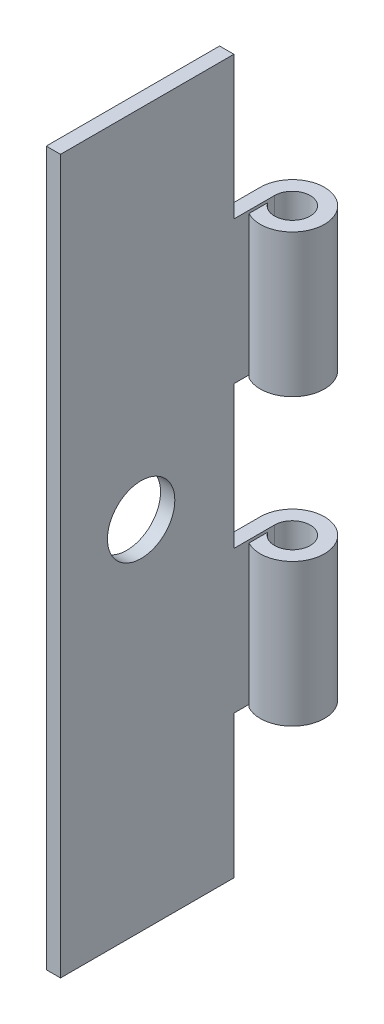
from build123d import *

# Parameters (mm, degrees)
BOSS_EXTRUDE1_DEPTH = 31.75
BOSS_EXTRUDE2_DEPTH = 31.75
SKETCH7_W           = 3.6195
SKETCH7_H           = 6.35
CUT_EXTRUDE2_DEPTH  = 34.270909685
SKETCH8_W           = 3.6195
SKETCH8_H           = 6.35
CUT_EXTRUDE3_DEPTH  = 34.270909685
SKETCH10_W          = 3.6195
SKETCH10_H          = 6.35
CUT_EXTRUDE4_DEPTH  = 34.270909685
CUT_EXTRUDE5_DEPTH  = 6.35
CUT_EXTRUDE6_START  = -6.35
CUT_EXTRUDE6_DEPTH  = 6.35
SKETCH21_R          = 1.5
CUT_EXTRUDE8_DEPTH  = 34.222396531
SKETCH22_W          = 9.106958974
SKETCH22_H          = 22.331357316
CUT_EXTRUDE9_DEPTH  = 34.222396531


with BuildPart() as part:
    # Sketch3 → Boss-Extrude1 (new body)
    with BuildSketch(Plane(origin=(0, 0, 0), x_dir=(1, 0, 0), z_dir=(0, 1, 0))):
        with BuildLine():
            Line((0.635, 9.525), (0, 9.525))
            Line((0, 9.525), (0, 0))
            ThreePointArc((0, 0), (2.652258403, -0.737803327), (0.762, 1.263634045))
            Line((0.762, 1.263634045), (0.762, 0.430677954))
            ThreePointArc((0.762, 0.430677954), (2.190088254, -0.224506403), (0.635, 0))
            Line((0.635, 0), (0.635, 9.525))
        make_face()
    extrude(amount=BOSS_EXTRUDE1_DEPTH)

    # Sketch7 → Cut-Extrude2 (cut, through all)
    with BuildSketch(Plane(origin=(0, 0, 0), x_dir=(0, 0, -1), z_dir=(1, 0, 0))):
        with Locations((0, 34.925)):
            Rectangle(SKETCH7_W, SKETCH7_H)
        with Locations((0, 9.525)):
            Rectangle(SKETCH7_W, SKETCH7_H)
        with Locations((0, 22.225)):
            Rectangle(SKETCH7_W, SKETCH7_H)
    extrude(amount=CUT_EXTRUDE2_DEPTH, mode=Mode.SUBTRACT)

    # Sketch10 → Cut-Extrude4 (cut, through all)
    with BuildSketch(Plane(origin=(0, 0, 0), x_dir=(0, 0, -1), z_dir=(1, 0, 0))):
        with Locations((0, 15.875)):
            Rectangle(SKETCH10_W, SKETCH10_H)
    extrude(amount=CUT_EXTRUDE4_DEPTH, mode=Mode.SUBTRACT)

    # Sketch17 → Cut-Extrude5 (cut)
    with BuildSketch(Plane.XZ):
        with BuildLine():
            Line((1.42875, -1.42875), (1.42875, -9.812619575))
            Line((1.42875, -9.812619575), (-0.279586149, -9.812619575))
            Line((-0.279586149, -9.812619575), (0, 0))
            ThreePointArc((0, 0), (2.439028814, 1.010278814), (1.42875, -1.42875))
        make_face()
    extrude(amount=-CUT_EXTRUDE5_DEPTH, mode=Mode.SUBTRACT)

    # Sketch18 → Cut-Extrude6 (cut)
    with BuildSketch(Plane(origin=(0, 31.75, 0), x_dir=(1, 0, 0), z_dir=(0, 1, 0)).offset(CUT_EXTRUDE6_START)):
        with BuildLine():
            Line((0, 0), (0, 9.525))
            Line((0, 9.525), (0.635, 9.525))
            Line((0.635, 9.525), (0.635, 1.18797622))
            ThreePointArc((0.635, 1.18797622), (2.688789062, -0.673519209), (0, 0))
        make_face()
    extrude(amount=CUT_EXTRUDE6_DEPTH, mode=Mode.SUBTRACT)

    # Sketch22 → Cut-Extrude9 (cut, through all)
    with BuildSketch(Plane(origin=(0.635, 0, 0), x_dir=(0, 0, -1), z_dir=(1, 0, 0))):
        with Locations((6.197296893, 16.001473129)):
            Rectangle(SKETCH22_W, SKETCH22_H)
    extrude(amount=-CUT_EXTRUDE9_DEPTH, mode=Mode.SUBTRACT)


with BuildPart() as body_2:
    # Sketch4 → Boss-Extrude2 (new body)
    with BuildSketch(Plane(origin=(0, 0, 0), x_dir=(1, 0, 0), z_dir=(0, 1, 0))):
        with BuildLine():
            Line((0, 0), (0, -9.525))
            Line((0, -9.525), (0.635, -9.525))
            Line((0.635, -9.525), (0.635, 0))
            ThreePointArc((0.635, 0), (2.190088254, 0.224506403), (0.762, -0.430677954))
            Line((0.762, -0.430677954), (0.762, -1.263634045))
            ThreePointArc((0.762, -1.263634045), (2.652258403, 0.737803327), (0, 0))
        make_face()
    extrude(amount=BOSS_EXTRUDE2_DEPTH)

    # Sketch8 → Cut-Extrude3 (cut, through all)
    with BuildSketch(Plane(origin=(0, 0, 0), x_dir=(0, 0, -1), z_dir=(1, 0, 0))):
        with Locations((0, 3.175)):
            Rectangle(SKETCH8_W, SKETCH8_H)
        with Locations((0, 15.875)):
            Rectangle(SKETCH8_W, SKETCH8_H)
        with Locations((0, 28.575)):
            Rectangle(SKETCH8_W, SKETCH8_H)
    extrude(amount=CUT_EXTRUDE3_DEPTH, mode=Mode.SUBTRACT)

    # Sketch21 → Cut-Extrude8 (cut, through all)
    with BuildSketch(Plane(origin=(0.635, 0, 0), x_dir=(0, 0, -1), z_dir=(1, 0, 0))):
        with Locations((-5.93725, 15.875)):
            Circle(SKETCH21_R)
    extrude(amount=-CUT_EXTRUDE8_DEPTH, mode=Mode.SUBTRACT)


solid = body_2.part
